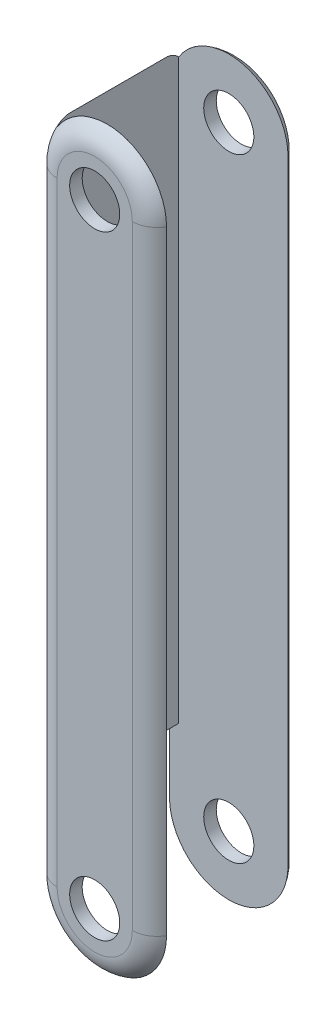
from build123d import *

# Parameters (mm, degrees)
BASE_EXTRUSION_DEPTH    = 11.7
CONG_1_R                = 2
CONG_3_R                = 2
ENL_V_MAT_EXTRU_4_DEPTH = 9
ESQUISSE7_W             = 9.7
ESQUISSE7_H             = 10.06
ENL_V_MAT_EXTRU_5_DEPTH = 9
ESQUISSE8_R             = 2
ENL_V_MAT_EXTRU_6_DEPTH = 56.845645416


with BuildPart() as part:
    # Esquisse1 → Base-Extrusion (new body)
    with BuildSketch(Plane.XY):
        with BuildLine():
            Line((0, 49), (0, 0))
            ThreePointArc((0, 0), (5, -5), (10, 0))
            Line((10, 0), (10, 49))
            ThreePointArc((10, 49), (5, 54), (0, 49))
        make_face()
    extrude(amount=BASE_EXTRUSION_DEPTH)

    # Cong_1
    cong_1_edges = [part.edges().sort_by_distance(p)[0] for p in [
        (5, -5, 11.7),
        (10, 24.5, 11.7),
        (5, 54, 11.7),
        (0, 24.5, 11.7),
    ]]
    fillet(cong_1_edges, radius=CONG_1_R)

    # Cong_3
    cong_3_edges = [part.edges().sort_by_distance(p)[0] for p in [
        (10, 24.5, 0),
        (5, -5, 0),
        (0, 24.5, 0),
        (5, 54, 0),
    ]]
    fillet(cong_3_edges, radius=CONG_3_R)

    # Esquisse6 → Enl_v. mat.-Extru.4 (cut)
    with BuildSketch(Plane(origin=(10, 0, 0), x_dir=(0, 0, -1), z_dir=(1, 0, 0))):
        Polygon((-10.7, 58.014149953), (-10.7, -9.353860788), (-1, -9.353860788), (-1, 56.548715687), align=None)
    extrude(amount=-ENL_V_MAT_EXTRU_4_DEPTH, mode=Mode.SUBTRACT)

    # Esquisse7 → Enl_v. mat.-Extru.5 (cut)
    with BuildSketch(Plane.ZY):
        with Locations((5.85, 0.429072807)):
            Rectangle(ESQUISSE7_W, ESQUISSE7_H)
    extrude(amount=-ENL_V_MAT_EXTRU_5_DEPTH, mode=Mode.SUBTRACT)

    # Esquisse8 → Enl_v. mat.-Extru.6 (cut, through all)
    with BuildSketch(Plane(origin=(0, 0, 0), x_dir=(-1, 0, 0), z_dir=(0, 0, -1))):
        with Locations((-5, 0)):
            Circle(ESQUISSE8_R)
        with Locations((-5, 49)):
            Circle(ESQUISSE8_R)
    extrude(amount=-ENL_V_MAT_EXTRU_6_DEPTH, mode=Mode.SUBTRACT)


solid = part.part
